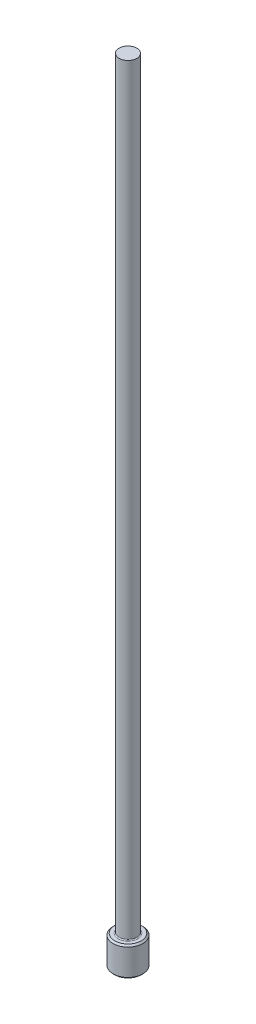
from build123d import *

# Parameters (mm, degrees)
CHAMFER1_SIZE = 0.127
FILLET1_R     = 0.0762


with BuildPart() as part:
    # Sketch1 → Revolve1 (revolve)
    with BuildSketch(Plane.XY, mode=Mode.PRIVATE) as revolve1_sk:
        Polygon((0, 0), (-1.1938, 0), (-1.1938, 2.3622), (-0.7112, 2.3622), (-0.7112, 63.5), (0, 63.5), align=None)
    revolve(revolve1_sk.sketch.rotate(Axis((0, 259.958771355, 0), (0, -1, 0)), 270), axis=Axis((0, 259.958771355, 0), (0, -1, 0)))

    # Chamfer1
    chamfer1_edges = [part.edges().sort_by_distance(p)[0] for p in [
        (0, 2.3622, -1.1938),
        (0, 0, -1.1938),
    ]]
    chamfer(chamfer1_edges, length=CHAMFER1_SIZE)

    # Fillet1
    fillet1_edges = [part.edges().sort_by_distance(p)[0] for p in [
        (0, 2.3622, -0.7112),
    ]]
    fillet(fillet1_edges, radius=FILLET1_R)


solid = part.part
